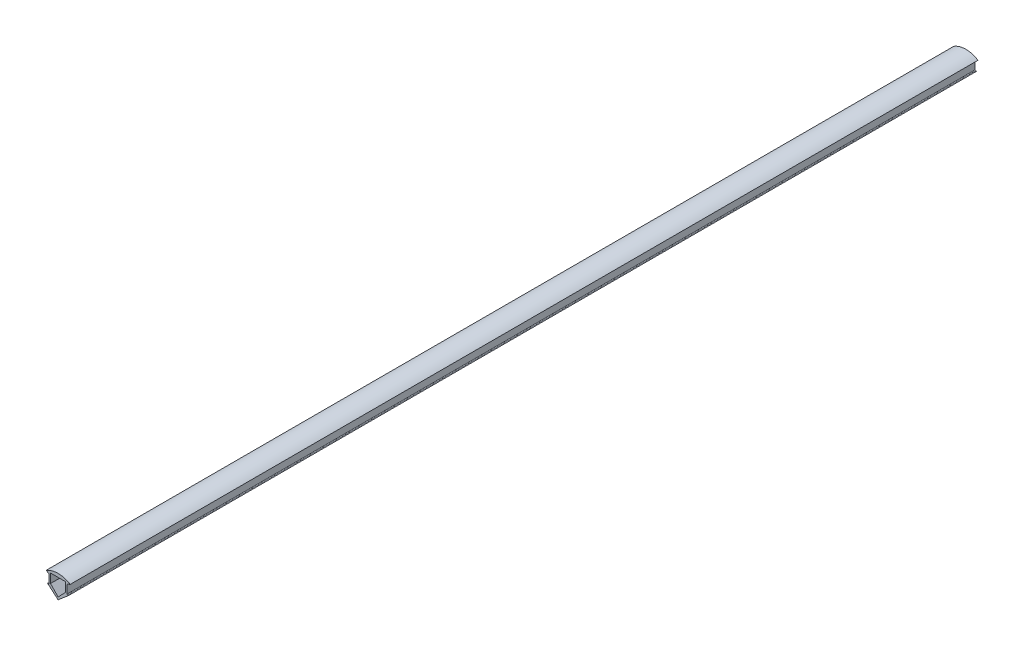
ISO-10303-21;
HEADER;
FILE_DESCRIPTION(('STEP AP214'),'2;1');
FILE_NAME('part.step','',(''),(''),'','','');
FILE_SCHEMA(('AUTOMOTIVE_DESIGN { 1 0 10303 214 1 1 1 1 }'));
ENDSEC;
DATA;
#1=APPLICATION_CONTEXT('core data for automotive mechanical design processes');
#2=APPLICATION_PROTOCOL_DEFINITION('international standard','automotive_design',2000,#1);
#3=PRODUCT_CONTEXT('',#1,'mechanical');
#4=PRODUCT('Part','Part','',(#3));
#5=PRODUCT_RELATED_PRODUCT_CATEGORY('part','',(#4));
#6=PRODUCT_DEFINITION_FORMATION('','',#4);
#7=PRODUCT_DEFINITION_CONTEXT('part definition',#1,'design');
#8=PRODUCT_DEFINITION('design','',#6,#7);
#9=PRODUCT_DEFINITION_SHAPE('','',#8);
#10=(LENGTH_UNIT() NAMED_UNIT(*) SI_UNIT(.MILLI.,.METRE.));
#11=(NAMED_UNIT(*) PLANE_ANGLE_UNIT() SI_UNIT($,.RADIAN.));
#12=(NAMED_UNIT(*) SI_UNIT($,.STERADIAN.) SOLID_ANGLE_UNIT());
#13=UNCERTAINTY_MEASURE_WITH_UNIT(LENGTH_MEASURE(1.E-05),#10,'distance_accuracy_value','');
#14=(GEOMETRIC_REPRESENTATION_CONTEXT(3) GLOBAL_UNCERTAINTY_ASSIGNED_CONTEXT((#13)) GLOBAL_UNIT_ASSIGNED_CONTEXT((#10,
#11,#12)) REPRESENTATION_CONTEXT('',''));
#15=CARTESIAN_POINT('',(0.,0.,0.));
#16=DIRECTION('',(0.,0.,1.));
#17=DIRECTION('',(1.,0.,0.));
#18=AXIS2_PLACEMENT_3D('',#15,#16,#17);
#19=CARTESIAN_POINT('',(-3.2,0.200000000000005,150.));
#20=DIRECTION('',(0.,0.,1.));
#21=DIRECTION('',(1.,0.,0.));
#22=AXIS2_PLACEMENT_3D('',#19,#20,#21);
#23=PLANE('',#22);
#24=CARTESIAN_POINT('',(-3.2,0.200000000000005,150.));
#25=DIRECTION('',(0.,0.,-1.));
#26=DIRECTION('',(1.,0.,0.));
#27=AXIS2_PLACEMENT_3D('',#24,#25,#26);
#28=CIRCLE('',#27,0.2);
#29=CARTESIAN_POINT('',(-3.,0.200000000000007,150.));
#30=VERTEX_POINT('',#29);
#31=CARTESIAN_POINT('',(-3.20000000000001,0.,150.));
#32=VERTEX_POINT('',#31);
#33=EDGE_CURVE('E205',#30,#32,#28,.T.);
#34=ORIENTED_EDGE('',*,*,#33,.T.);
#35=DIRECTION('',(-1.,0.,0.));
#36=VECTOR('',#35,1.);
#37=CARTESIAN_POINT('',(-3.5,0.,150.));
#38=LINE('',#37,#36);
#39=CARTESIAN_POINT('',(-3.5,0.,150.));
#40=VERTEX_POINT('',#39);
#41=EDGE_CURVE('E208',#32,#40,#38,.T.);
#42=ORIENTED_EDGE('',*,*,#41,.T.);
#43=DIRECTION('',(0.759256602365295,-0.65079137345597,0.));
#44=VECTOR('',#43,1.);
#45=CARTESIAN_POINT('',(0.,-3.,150.));
#46=LINE('',#45,#44);
#47=CARTESIAN_POINT('',(0.,-3.,150.));
#48=VERTEX_POINT('',#47);
#49=EDGE_CURVE('E211',#40,#48,#46,.T.);
#50=ORIENTED_EDGE('',*,*,#49,.T.);
#51=DIRECTION('',(0.759256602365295,0.65079137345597,0.));
#52=VECTOR('',#51,1.);
#53=CARTESIAN_POINT('',(0.,-3.,150.));
#54=LINE('',#53,#52);
#55=CARTESIAN_POINT('',(3.5,0.,150.));
#56=VERTEX_POINT('',#55);
#57=EDGE_CURVE('E213',#48,#56,#54,.T.);
#58=ORIENTED_EDGE('',*,*,#57,.T.);
#59=DIRECTION('',(-1.,0.,0.));
#60=VECTOR('',#59,1.);
#61=CARTESIAN_POINT('',(3.5,0.,150.));
#62=LINE('',#61,#60);
#63=CARTESIAN_POINT('',(3.20000000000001,0.,150.));
#64=VERTEX_POINT('',#63);
#65=EDGE_CURVE('E215',#56,#64,#62,.T.);
#66=ORIENTED_EDGE('',*,*,#65,.T.);
#67=CARTESIAN_POINT('',(3.2,0.200000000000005,150.));
#68=DIRECTION('',(0.,0.,-1.));
#69=DIRECTION('',(-1.,0.,0.));
#70=AXIS2_PLACEMENT_3D('',#67,#68,#69);
#71=CIRCLE('',#70,0.2);
#72=CARTESIAN_POINT('',(3.,0.200000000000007,150.));
#73=VERTEX_POINT('',#72);
#74=EDGE_CURVE('E217',#64,#73,#71,.T.);
#75=ORIENTED_EDGE('',*,*,#74,.T.);
#76=DIRECTION('',(0.,1.,0.));
#77=VECTOR('',#76,1.);
#78=CARTESIAN_POINT('',(3.,0.200000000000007,150.));
#79=LINE('',#78,#77);
#80=CARTESIAN_POINT('',(3.,2.867696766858,150.));
#81=VERTEX_POINT('',#80);
#82=EDGE_CURVE('E219',#73,#81,#79,.T.);
#83=ORIENTED_EDGE('',*,*,#82,.T.);
#84=CARTESIAN_POINT('',(3.2,2.867696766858,150.));
#85=DIRECTION('',(0.,0.,-1.));
#86=DIRECTION('',(-1.,0.,0.));
#87=AXIS2_PLACEMENT_3D('',#84,#85,#86);
#88=CIRCLE('',#87,0.2);
#89=CARTESIAN_POINT('',(3.12175919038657,3.05175756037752,150.));
#90=VERTEX_POINT('',#89);
#91=EDGE_CURVE('E221',#81,#90,#88,.T.);
#92=ORIENTED_EDGE('',*,*,#91,.T.);
#93=DIRECTION('',(0.920303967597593,0.391204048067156,0.));
#94=VECTOR('',#93,1.);
#95=CARTESIAN_POINT('',(4.,3.42508134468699,150.));
#96=LINE('',#95,#94);
#97=CARTESIAN_POINT('',(4.,3.42508134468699,150.));
#98=VERTEX_POINT('',#97);
#99=EDGE_CURVE('E223',#90,#98,#96,.T.);
#100=ORIENTED_EDGE('',*,*,#99,.T.);
#101=CARTESIAN_POINT('',(0.,-3.,150.));
#102=DIRECTION('',(0.,0.,1.));
#103=DIRECTION('',(1.,0.,0.));
#104=AXIS2_PLACEMENT_3D('',#101,#102,#103);
#105=CIRCLE('',#104,7.56846551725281);
#106=CARTESIAN_POINT('',(-4.,3.42508134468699,150.));
#107=VERTEX_POINT('',#106);
#108=EDGE_CURVE('E225',#98,#107,#105,.T.);
#109=ORIENTED_EDGE('',*,*,#108,.T.);
#110=DIRECTION('',(0.920303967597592,-0.391204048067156,0.));
#111=VECTOR('',#110,1.);
#112=CARTESIAN_POINT('',(-4.,3.42508134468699,150.));
#113=LINE('',#112,#111);
#114=CARTESIAN_POINT('',(-3.12175919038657,3.05175756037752,150.));
#115=VERTEX_POINT('',#114);
#116=EDGE_CURVE('E227',#107,#115,#113,.T.);
#117=ORIENTED_EDGE('',*,*,#116,.T.);
#118=CARTESIAN_POINT('',(-3.2,2.867696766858,150.));
#119=DIRECTION('',(0.,0.,-1.));
#120=DIRECTION('',(1.,0.,0.));
#121=AXIS2_PLACEMENT_3D('',#118,#119,#120);
#122=CIRCLE('',#121,0.2);
#123=CARTESIAN_POINT('',(-3.,2.867696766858,150.));
#124=VERTEX_POINT('',#123);
#125=EDGE_CURVE('E229',#115,#124,#122,.T.);
#126=ORIENTED_EDGE('',*,*,#125,.T.);
#127=DIRECTION('',(0.,-1.,0.));
#128=VECTOR('',#127,1.);
#129=CARTESIAN_POINT('',(-3.,0.200000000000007,150.));
#130=LINE('',#129,#128);
#131=EDGE_CURVE('E231',#124,#30,#130,.T.);
#132=ORIENTED_EDGE('',*,*,#131,.T.);
#133=EDGE_LOOP('',(#34,#42,#50,#58,#66,#75,#83,#92,#100,#109,#117,#126,#132));
#134=FACE_BOUND('',#133,.T.);
#135=DIRECTION('',(0.,1.,0.));
#136=VECTOR('',#135,1.);
#137=CARTESIAN_POINT('',(2.5,3.42508134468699,150.));
#138=LINE('',#137,#136);
#139=CARTESIAN_POINT('',(2.5,0.425081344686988,150.));
#140=VERTEX_POINT('',#139);
#141=CARTESIAN_POINT('',(2.5,3.42508134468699,150.));
#142=VERTEX_POINT('',#141);
#143=EDGE_CURVE('E169',#140,#142,#138,.T.);
#144=ORIENTED_EDGE('',*,*,#143,.F.);
#145=DIRECTION('',(0.689592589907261,0.724197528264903,0.));
#146=VECTOR('',#145,1.);
#147=CARTESIAN_POINT('',(0.,-2.20037294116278,150.));
#148=LINE('',#147,#146);
#149=CARTESIAN_POINT('',(0.,-2.20037294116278,150.));
#150=VERTEX_POINT('',#149);
#151=EDGE_CURVE('E161',#150,#140,#148,.T.);
#152=ORIENTED_EDGE('',*,*,#151,.F.);
#153=DIRECTION('',(0.689592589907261,-0.724197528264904,0.));
#154=VECTOR('',#153,1.);
#155=CARTESIAN_POINT('',(-2.5,0.425081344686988,150.));
#156=LINE('',#155,#154);
#157=CARTESIAN_POINT('',(-2.5,0.425081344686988,150.));
#158=VERTEX_POINT('',#157);
#159=EDGE_CURVE('E188',#158,#150,#156,.T.);
#160=ORIENTED_EDGE('',*,*,#159,.F.);
#161=DIRECTION('',(0.,-1.,0.));
#162=VECTOR('',#161,1.);
#163=CARTESIAN_POINT('',(-2.5,3.42508134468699,150.));
#164=LINE('',#163,#162);
#165=CARTESIAN_POINT('',(-2.5,3.42508134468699,150.));
#166=VERTEX_POINT('',#165);
#167=EDGE_CURVE('E184',#166,#158,#164,.T.);
#168=ORIENTED_EDGE('',*,*,#167,.F.);
#169=DIRECTION('',(-1.,0.,0.));
#170=VECTOR('',#169,1.);
#171=CARTESIAN_POINT('',(-2.5,3.42508134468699,150.));
#172=LINE('',#171,#170);
#173=EDGE_CURVE('E182',#142,#166,#172,.T.);
#174=ORIENTED_EDGE('',*,*,#173,.F.);
#175=EDGE_LOOP('',(#144,#152,#160,#168,#174));
#176=FACE_BOUND('',#175,.T.);
#177=ADVANCED_FACE('F36',(#134,#176),#23,.T.);
#178=CARTESIAN_POINT('',(-3.2,0.200000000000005,-150.));
#179=DIRECTION('',(0.,0.,1.));
#180=DIRECTION('',(1.,0.,0.));
#181=AXIS2_PLACEMENT_3D('',#178,#179,#180);
#182=PLANE('',#181);
#183=CARTESIAN_POINT('',(-3.2,0.200000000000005,-150.));
#184=DIRECTION('',(0.,0.,-1.));
#185=DIRECTION('',(1.,0.,0.));
#186=AXIS2_PLACEMENT_3D('',#183,#184,#185);
#187=CIRCLE('',#186,0.2);
#188=CARTESIAN_POINT('',(-3.,0.200000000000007,-150.));
#189=VERTEX_POINT('',#188);
#190=CARTESIAN_POINT('',(-3.20000000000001,0.,-150.));
#191=VERTEX_POINT('',#190);
#192=EDGE_CURVE('E177',#189,#191,#187,.T.);
#193=ORIENTED_EDGE('',*,*,#192,.F.);
#194=DIRECTION('',(0.,-1.,0.));
#195=VECTOR('',#194,1.);
#196=CARTESIAN_POINT('',(-3.,0.200000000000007,-150.));
#197=LINE('',#196,#195);
#198=CARTESIAN_POINT('',(-3.,2.867696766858,-150.));
#199=VERTEX_POINT('',#198);
#200=EDGE_CURVE('E209',#199,#189,#197,.T.);
#201=ORIENTED_EDGE('',*,*,#200,.F.);
#202=CARTESIAN_POINT('',(-3.2,2.867696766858,-150.));
#203=DIRECTION('',(0.,0.,-1.));
#204=DIRECTION('',(1.,0.,0.));
#205=AXIS2_PLACEMENT_3D('',#202,#203,#204);
#206=CIRCLE('',#205,0.2);
#207=CARTESIAN_POINT('',(-3.12175919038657,3.05175756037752,-150.));
#208=VERTEX_POINT('',#207);
#209=EDGE_CURVE('E256',#208,#199,#206,.T.);
#210=ORIENTED_EDGE('',*,*,#209,.F.);
#211=DIRECTION('',(0.920303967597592,-0.391204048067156,0.));
#212=VECTOR('',#211,1.);
#213=CARTESIAN_POINT('',(-4.,3.42508134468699,-150.));
#214=LINE('',#213,#212);
#215=CARTESIAN_POINT('',(-4.,3.42508134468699,-150.));
#216=VERTEX_POINT('',#215);
#217=EDGE_CURVE('E254',#216,#208,#214,.T.);
#218=ORIENTED_EDGE('',*,*,#217,.F.);
#219=CARTESIAN_POINT('',(0.,-3.,-150.));
#220=DIRECTION('',(0.,0.,1.));
#221=DIRECTION('',(1.,0.,0.));
#222=AXIS2_PLACEMENT_3D('',#219,#220,#221);
#223=CIRCLE('',#222,7.56846551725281);
#224=CARTESIAN_POINT('',(4.,3.42508134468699,-150.));
#225=VERTEX_POINT('',#224);
#226=EDGE_CURVE('E252',#225,#216,#223,.T.);
#227=ORIENTED_EDGE('',*,*,#226,.F.);
#228=DIRECTION('',(0.920303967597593,0.391204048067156,0.));
#229=VECTOR('',#228,1.);
#230=CARTESIAN_POINT('',(4.,3.42508134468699,-150.));
#231=LINE('',#230,#229);
#232=CARTESIAN_POINT('',(3.12175919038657,3.05175756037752,-150.));
#233=VERTEX_POINT('',#232);
#234=EDGE_CURVE('E250',#233,#225,#231,.T.);
#235=ORIENTED_EDGE('',*,*,#234,.F.);
#236=CARTESIAN_POINT('',(3.2,2.867696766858,-150.));
#237=DIRECTION('',(0.,0.,-1.));
#238=DIRECTION('',(-1.,0.,0.));
#239=AXIS2_PLACEMENT_3D('',#236,#237,#238);
#240=CIRCLE('',#239,0.2);
#241=CARTESIAN_POINT('',(3.,2.867696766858,-150.));
#242=VERTEX_POINT('',#241);
#243=EDGE_CURVE('E248',#242,#233,#240,.T.);
#244=ORIENTED_EDGE('',*,*,#243,.F.);
#245=DIRECTION('',(0.,1.,0.));
#246=VECTOR('',#245,1.);
#247=CARTESIAN_POINT('',(3.,0.200000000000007,-150.));
#248=LINE('',#247,#246);
#249=CARTESIAN_POINT('',(3.,0.200000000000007,-150.));
#250=VERTEX_POINT('',#249);
#251=EDGE_CURVE('E246',#250,#242,#248,.T.);
#252=ORIENTED_EDGE('',*,*,#251,.F.);
#253=CARTESIAN_POINT('',(3.2,0.200000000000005,-150.));
#254=DIRECTION('',(0.,0.,-1.));
#255=DIRECTION('',(-1.,0.,0.));
#256=AXIS2_PLACEMENT_3D('',#253,#254,#255);
#257=CIRCLE('',#256,0.2);
#258=CARTESIAN_POINT('',(3.20000000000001,0.,-150.));
#259=VERTEX_POINT('',#258);
#260=EDGE_CURVE('E244',#259,#250,#257,.T.);
#261=ORIENTED_EDGE('',*,*,#260,.F.);
#262=DIRECTION('',(-1.,0.,0.));
#263=VECTOR('',#262,1.);
#264=CARTESIAN_POINT('',(3.5,0.,-150.));
#265=LINE('',#264,#263);
#266=CARTESIAN_POINT('',(3.5,0.,-150.));
#267=VERTEX_POINT('',#266);
#268=EDGE_CURVE('E242',#267,#259,#265,.T.);
#269=ORIENTED_EDGE('',*,*,#268,.F.);
#270=DIRECTION('',(0.759256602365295,0.65079137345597,0.));
#271=VECTOR('',#270,1.);
#272=CARTESIAN_POINT('',(0.,-3.,-150.));
#273=LINE('',#272,#271);
#274=CARTESIAN_POINT('',(0.,-3.,-150.));
#275=VERTEX_POINT('',#274);
#276=EDGE_CURVE('E240',#275,#267,#273,.T.);
#277=ORIENTED_EDGE('',*,*,#276,.F.);
#278=DIRECTION('',(0.759256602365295,-0.65079137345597,0.));
#279=VECTOR('',#278,1.);
#280=CARTESIAN_POINT('',(0.,-3.,-150.));
#281=LINE('',#280,#279);
#282=CARTESIAN_POINT('',(-3.5,0.,-150.));
#283=VERTEX_POINT('',#282);
#284=EDGE_CURVE('E238',#283,#275,#281,.T.);
#285=ORIENTED_EDGE('',*,*,#284,.F.);
#286=DIRECTION('',(-1.,0.,0.));
#287=VECTOR('',#286,1.);
#288=CARTESIAN_POINT('',(-3.5,0.,-150.));
#289=LINE('',#288,#287);
#290=EDGE_CURVE('E236',#191,#283,#289,.T.);
#291=ORIENTED_EDGE('',*,*,#290,.F.);
#292=EDGE_LOOP('',(#193,#201,#210,#218,#227,#235,#244,#252,#261,#269,#277,#285,#291));
#293=FACE_BOUND('',#292,.T.);
#294=DIRECTION('',(0.689592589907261,0.724197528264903,0.));
#295=VECTOR('',#294,1.);
#296=CARTESIAN_POINT('',(0.,-2.20037294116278,-150.));
#297=LINE('',#296,#295);
#298=CARTESIAN_POINT('',(0.,-2.20037294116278,-150.));
#299=VERTEX_POINT('',#298);
#300=CARTESIAN_POINT('',(2.5,0.425081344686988,-150.));
#301=VERTEX_POINT('',#300);
#302=EDGE_CURVE('E59',#299,#301,#297,.T.);
#303=ORIENTED_EDGE('',*,*,#302,.T.);
#304=DIRECTION('',(0.,1.,0.));
#305=VECTOR('',#304,1.);
#306=CARTESIAN_POINT('',(2.5,3.42508134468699,-150.));
#307=LINE('',#306,#305);
#308=CARTESIAN_POINT('',(2.5,3.42508134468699,-150.));
#309=VERTEX_POINT('',#308);
#310=EDGE_CURVE('E176',#301,#309,#307,.T.);
#311=ORIENTED_EDGE('',*,*,#310,.T.);
#312=DIRECTION('',(-1.,0.,0.));
#313=VECTOR('',#312,1.);
#314=CARTESIAN_POINT('',(-2.5,3.42508134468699,-150.));
#315=LINE('',#314,#313);
#316=CARTESIAN_POINT('',(-2.5,3.42508134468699,-150.));
#317=VERTEX_POINT('',#316);
#318=EDGE_CURVE('E192',#309,#317,#315,.T.);
#319=ORIENTED_EDGE('',*,*,#318,.T.);
#320=DIRECTION('',(0.,-1.,0.));
#321=VECTOR('',#320,1.);
#322=CARTESIAN_POINT('',(-2.5,3.42508134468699,-150.));
#323=LINE('',#322,#321);
#324=CARTESIAN_POINT('',(-2.5,0.425081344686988,-150.));
#325=VERTEX_POINT('',#324);
#326=EDGE_CURVE('E195',#317,#325,#323,.T.);
#327=ORIENTED_EDGE('',*,*,#326,.T.);
#328=DIRECTION('',(0.689592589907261,-0.724197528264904,0.));
#329=VECTOR('',#328,1.);
#330=CARTESIAN_POINT('',(-2.5,0.425081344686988,-150.));
#331=LINE('',#330,#329);
#332=EDGE_CURVE('E170',#325,#299,#331,.T.);
#333=ORIENTED_EDGE('',*,*,#332,.T.);
#334=EDGE_LOOP('',(#303,#311,#319,#327,#333));
#335=FACE_BOUND('',#334,.T.);
#336=ADVANCED_FACE('F301',(#293,#335),#182,.F.);
#337=CARTESIAN_POINT('',(-3.2,0.200000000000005,150.));
#338=DIRECTION('',(0.,0.,-1.));
#339=DIRECTION('',(-1.,0.,0.));
#340=AXIS2_PLACEMENT_3D('',#337,#338,#339);
#341=CYLINDRICAL_SURFACE('',#340,0.2);
#342=ORIENTED_EDGE('',*,*,#192,.T.);
#343=DIRECTION('',(0.,0.,-1.));
#344=VECTOR('',#343,1.);
#345=CARTESIAN_POINT('',(-3.20000000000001,0.,150.));
#346=LINE('',#345,#344);
#347=EDGE_CURVE('E11',#32,#191,#346,.T.);
#348=ORIENTED_EDGE('',*,*,#347,.F.);
#349=ORIENTED_EDGE('',*,*,#33,.F.);
#350=DIRECTION('',(0.,0.,-1.));
#351=VECTOR('',#350,1.);
#352=CARTESIAN_POINT('',(-3.,0.200000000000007,150.));
#353=LINE('',#352,#351);
#354=EDGE_CURVE('E233',#30,#189,#353,.T.);
#355=ORIENTED_EDGE('',*,*,#354,.T.);
#356=EDGE_LOOP('',(#342,#348,#349,#355));
#357=FACE_BOUND('',#356,.T.);
#358=ADVANCED_FACE('F38',(#357),#341,.F.);
#359=CARTESIAN_POINT('',(-3.5,0.,150.));
#360=DIRECTION('',(0.,-1.,0.));
#361=DIRECTION('',(1.,0.,0.));
#362=AXIS2_PLACEMENT_3D('',#359,#360,#361);
#363=PLANE('',#362);
#364=ORIENTED_EDGE('',*,*,#290,.T.);
#365=DIRECTION('',(0.,0.,-1.));
#366=VECTOR('',#365,1.);
#367=CARTESIAN_POINT('',(-3.5,0.,150.));
#368=LINE('',#367,#366);
#369=EDGE_CURVE('E44',#40,#283,#368,.T.);
#370=ORIENTED_EDGE('',*,*,#369,.F.);
#371=ORIENTED_EDGE('',*,*,#41,.F.);
#372=ORIENTED_EDGE('',*,*,#347,.T.);
#373=EDGE_LOOP('',(#364,#370,#371,#372));
#374=FACE_BOUND('',#373,.T.);
#375=ADVANCED_FACE('F318',(#374),#363,.F.);
#376=CARTESIAN_POINT('',(0.,-3.,150.));
#377=DIRECTION('',(0.65079137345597,0.759256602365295,0.));
#378=DIRECTION('',(-0.759256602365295,0.65079137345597,0.));
#379=AXIS2_PLACEMENT_3D('',#376,#377,#378);
#380=PLANE('',#379);
#381=ORIENTED_EDGE('',*,*,#284,.T.);
#382=DIRECTION('',(0.,0.,-1.));
#383=VECTOR('',#382,1.);
#384=CARTESIAN_POINT('',(0.,-3.,150.));
#385=LINE('',#384,#383);
#386=EDGE_CURVE('E288',#48,#275,#385,.T.);
#387=ORIENTED_EDGE('',*,*,#386,.F.);
#388=ORIENTED_EDGE('',*,*,#49,.F.);
#389=ORIENTED_EDGE('',*,*,#369,.T.);
#390=EDGE_LOOP('',(#381,#387,#388,#389));
#391=FACE_BOUND('',#390,.T.);
#392=ADVANCED_FACE('F295',(#391),#380,.F.);
#393=CARTESIAN_POINT('',(0.,-3.,150.));
#394=DIRECTION('',(-0.65079137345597,0.759256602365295,0.));
#395=DIRECTION('',(-0.759256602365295,-0.65079137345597,0.));
#396=AXIS2_PLACEMENT_3D('',#393,#394,#395);
#397=PLANE('',#396);
#398=ORIENTED_EDGE('',*,*,#276,.T.);
#399=DIRECTION('',(0.,0.,-1.));
#400=VECTOR('',#399,1.);
#401=CARTESIAN_POINT('',(3.5,0.,150.));
#402=LINE('',#401,#400);
#403=EDGE_CURVE('E285',#56,#267,#402,.T.);
#404=ORIENTED_EDGE('',*,*,#403,.F.);
#405=ORIENTED_EDGE('',*,*,#57,.F.);
#406=ORIENTED_EDGE('',*,*,#386,.T.);
#407=EDGE_LOOP('',(#398,#404,#405,#406));
#408=FACE_BOUND('',#407,.T.);
#409=ADVANCED_FACE('F307',(#408),#397,.F.);
#410=CARTESIAN_POINT('',(3.5,0.,150.));
#411=DIRECTION('',(0.,-1.,0.));
#412=DIRECTION('',(1.,0.,0.));
#413=AXIS2_PLACEMENT_3D('',#410,#411,#412);
#414=PLANE('',#413);
#415=ORIENTED_EDGE('',*,*,#268,.T.);
#416=DIRECTION('',(0.,0.,-1.));
#417=VECTOR('',#416,1.);
#418=CARTESIAN_POINT('',(3.20000000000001,0.,150.));
#419=LINE('',#418,#417);
#420=EDGE_CURVE('E282',#64,#259,#419,.T.);
#421=ORIENTED_EDGE('',*,*,#420,.F.);
#422=ORIENTED_EDGE('',*,*,#65,.F.);
#423=ORIENTED_EDGE('',*,*,#403,.T.);
#424=EDGE_LOOP('',(#415,#421,#422,#423));
#425=FACE_BOUND('',#424,.T.);
#426=ADVANCED_FACE('F311',(#425),#414,.F.);
#427=CARTESIAN_POINT('',(3.2,0.200000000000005,150.));
#428=DIRECTION('',(0.,0.,-1.));
#429=DIRECTION('',(-1.,0.,0.));
#430=AXIS2_PLACEMENT_3D('',#427,#428,#429);
#431=CYLINDRICAL_SURFACE('',#430,0.2);
#432=ORIENTED_EDGE('',*,*,#260,.T.);
#433=DIRECTION('',(0.,0.,-1.));
#434=VECTOR('',#433,1.);
#435=CARTESIAN_POINT('',(3.,0.200000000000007,150.));
#436=LINE('',#435,#434);
#437=EDGE_CURVE('E279',#73,#250,#436,.T.);
#438=ORIENTED_EDGE('',*,*,#437,.F.);
#439=ORIENTED_EDGE('',*,*,#74,.F.);
#440=ORIENTED_EDGE('',*,*,#420,.T.);
#441=EDGE_LOOP('',(#432,#438,#439,#440));
#442=FACE_BOUND('',#441,.T.);
#443=ADVANCED_FACE('F356',(#442),#431,.F.);
#444=CARTESIAN_POINT('',(3.,0.200000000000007,150.));
#445=DIRECTION('',(-1.,0.,0.));
#446=DIRECTION('',(0.,0.,1.));
#447=AXIS2_PLACEMENT_3D('',#444,#445,#446);
#448=PLANE('',#447);
#449=ORIENTED_EDGE('',*,*,#251,.T.);
#450=DIRECTION('',(0.,0.,-1.));
#451=VECTOR('',#450,1.);
#452=CARTESIAN_POINT('',(3.,2.867696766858,150.));
#453=LINE('',#452,#451);
#454=EDGE_CURVE('E276',#81,#242,#453,.T.);
#455=ORIENTED_EDGE('',*,*,#454,.F.);
#456=ORIENTED_EDGE('',*,*,#82,.F.);
#457=ORIENTED_EDGE('',*,*,#437,.T.);
#458=EDGE_LOOP('',(#449,#455,#456,#457));
#459=FACE_BOUND('',#458,.T.);
#460=ADVANCED_FACE('F353',(#459),#448,.F.);
#461=CARTESIAN_POINT('',(3.2,2.867696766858,150.));
#462=DIRECTION('',(0.,0.,-1.));
#463=DIRECTION('',(-1.,0.,0.));
#464=AXIS2_PLACEMENT_3D('',#461,#462,#463);
#465=CYLINDRICAL_SURFACE('',#464,0.2);
#466=ORIENTED_EDGE('',*,*,#243,.T.);
#467=DIRECTION('',(0.,0.,-1.));
#468=VECTOR('',#467,1.);
#469=CARTESIAN_POINT('',(3.12175919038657,3.05175756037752,150.));
#470=LINE('',#469,#468);
#471=EDGE_CURVE('E273',#90,#233,#470,.T.);
#472=ORIENTED_EDGE('',*,*,#471,.F.);
#473=ORIENTED_EDGE('',*,*,#91,.F.);
#474=ORIENTED_EDGE('',*,*,#454,.T.);
#475=EDGE_LOOP('',(#466,#472,#473,#474));
#476=FACE_BOUND('',#475,.T.);
#477=ADVANCED_FACE('F349',(#476),#465,.F.);
#478=CARTESIAN_POINT('',(4.,3.42508134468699,150.));
#479=DIRECTION('',(-0.391204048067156,0.920303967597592,0.));
#480=DIRECTION('',(-0.920303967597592,-0.391204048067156,0.));
#481=AXIS2_PLACEMENT_3D('',#478,#479,#480);
#482=PLANE('',#481);
#483=ORIENTED_EDGE('',*,*,#234,.T.);
#484=DIRECTION('',(0.,0.,-1.));
#485=VECTOR('',#484,1.);
#486=CARTESIAN_POINT('',(4.,3.42508134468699,150.));
#487=LINE('',#486,#485);
#488=EDGE_CURVE('E270',#98,#225,#487,.T.);
#489=ORIENTED_EDGE('',*,*,#488,.F.);
#490=ORIENTED_EDGE('',*,*,#99,.F.);
#491=ORIENTED_EDGE('',*,*,#471,.T.);
#492=EDGE_LOOP('',(#483,#489,#490,#491));
#493=FACE_BOUND('',#492,.T.);
#494=ADVANCED_FACE('F345',(#493),#482,.F.);
#495=CARTESIAN_POINT('',(0.,-3.,150.));
#496=DIRECTION('',(0.,0.,-1.));
#497=DIRECTION('',(-1.,0.,0.));
#498=AXIS2_PLACEMENT_3D('',#495,#496,#497);
#499=CYLINDRICAL_SURFACE('',#498,7.56846551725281);
#500=ORIENTED_EDGE('',*,*,#226,.T.);
#501=DIRECTION('',(0.,0.,-1.));
#502=VECTOR('',#501,1.);
#503=CARTESIAN_POINT('',(-4.,3.42508134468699,150.));
#504=LINE('',#503,#502);
#505=EDGE_CURVE('E267',#107,#216,#504,.T.);
#506=ORIENTED_EDGE('',*,*,#505,.F.);
#507=ORIENTED_EDGE('',*,*,#108,.F.);
#508=ORIENTED_EDGE('',*,*,#488,.T.);
#509=EDGE_LOOP('',(#500,#506,#507,#508));
#510=FACE_BOUND('',#509,.T.);
#511=ADVANCED_FACE('F340',(#510),#499,.T.);
#512=CARTESIAN_POINT('',(-4.,3.42508134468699,150.));
#513=DIRECTION('',(0.391204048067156,0.920303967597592,0.));
#514=DIRECTION('',(-0.920303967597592,0.391204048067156,0.));
#515=AXIS2_PLACEMENT_3D('',#512,#513,#514);
#516=PLANE('',#515);
#517=ORIENTED_EDGE('',*,*,#217,.T.);
#518=DIRECTION('',(0.,0.,-1.));
#519=VECTOR('',#518,1.);
#520=CARTESIAN_POINT('',(-3.12175919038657,3.05175756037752,150.));
#521=LINE('',#520,#519);
#522=EDGE_CURVE('E264',#115,#208,#521,.T.);
#523=ORIENTED_EDGE('',*,*,#522,.F.);
#524=ORIENTED_EDGE('',*,*,#116,.F.);
#525=ORIENTED_EDGE('',*,*,#505,.T.);
#526=EDGE_LOOP('',(#517,#523,#524,#525));
#527=FACE_BOUND('',#526,.T.);
#528=ADVANCED_FACE('F334',(#527),#516,.F.);
#529=CARTESIAN_POINT('',(-3.2,2.867696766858,150.));
#530=DIRECTION('',(0.,0.,-1.));
#531=DIRECTION('',(-1.,0.,0.));
#532=AXIS2_PLACEMENT_3D('',#529,#530,#531);
#533=CYLINDRICAL_SURFACE('',#532,0.2);
#534=ORIENTED_EDGE('',*,*,#209,.T.);
#535=DIRECTION('',(0.,0.,-1.));
#536=VECTOR('',#535,1.);
#537=CARTESIAN_POINT('',(-3.,2.867696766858,150.));
#538=LINE('',#537,#536);
#539=EDGE_CURVE('E261',#124,#199,#538,.T.);
#540=ORIENTED_EDGE('',*,*,#539,.F.);
#541=ORIENTED_EDGE('',*,*,#125,.F.);
#542=ORIENTED_EDGE('',*,*,#522,.T.);
#543=EDGE_LOOP('',(#534,#540,#541,#542));
#544=FACE_BOUND('',#543,.T.);
#545=ADVANCED_FACE('F330',(#544),#533,.F.);
#546=CARTESIAN_POINT('',(-3.,0.200000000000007,150.));
#547=DIRECTION('',(1.,0.,0.));
#548=DIRECTION('',(0.,0.,-1.));
#549=AXIS2_PLACEMENT_3D('',#546,#547,#548);
#550=PLANE('',#549);
#551=ORIENTED_EDGE('',*,*,#200,.T.);
#552=ORIENTED_EDGE('',*,*,#354,.F.);
#553=ORIENTED_EDGE('',*,*,#131,.F.);
#554=ORIENTED_EDGE('',*,*,#539,.T.);
#555=EDGE_LOOP('',(#551,#552,#553,#554));
#556=FACE_BOUND('',#555,.T.);
#557=ADVANCED_FACE('F325',(#556),#550,.F.);
#558=CARTESIAN_POINT('',(0.,-2.20037294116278,150.));
#559=DIRECTION('',(-0.724197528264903,0.689592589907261,0.));
#560=DIRECTION('',(-0.689592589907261,-0.724197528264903,0.));
#561=AXIS2_PLACEMENT_3D('',#558,#559,#560);
#562=PLANE('',#561);
#563=ORIENTED_EDGE('',*,*,#302,.F.);
#564=DIRECTION('',(0.,0.,-1.));
#565=VECTOR('',#564,1.);
#566=CARTESIAN_POINT('',(0.,-2.20037294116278,150.));
#567=LINE('',#566,#565);
#568=EDGE_CURVE('E165',#150,#299,#567,.T.);
#569=ORIENTED_EDGE('',*,*,#568,.F.);
#570=ORIENTED_EDGE('',*,*,#151,.T.);
#571=DIRECTION('',(0.,0.,-1.));
#572=VECTOR('',#571,1.);
#573=CARTESIAN_POINT('',(2.5,0.425081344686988,150.));
#574=LINE('',#573,#572);
#575=EDGE_CURVE('E164',#140,#301,#574,.T.);
#576=ORIENTED_EDGE('',*,*,#575,.T.);
#577=EDGE_LOOP('',(#563,#569,#570,#576));
#578=FACE_BOUND('',#577,.T.);
#579=ADVANCED_FACE('F163',(#578),#562,.T.);
#580=CARTESIAN_POINT('',(2.5,3.42508134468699,150.));
#581=DIRECTION('',(-1.,0.,0.));
#582=DIRECTION('',(0.,-1.,0.));
#583=AXIS2_PLACEMENT_3D('',#580,#581,#582);
#584=PLANE('',#583);
#585=ORIENTED_EDGE('',*,*,#310,.F.);
#586=ORIENTED_EDGE('',*,*,#575,.F.);
#587=ORIENTED_EDGE('',*,*,#143,.T.);
#588=DIRECTION('',(0.,0.,-1.));
#589=VECTOR('',#588,1.);
#590=CARTESIAN_POINT('',(2.5,3.42508134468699,150.));
#591=LINE('',#590,#589);
#592=EDGE_CURVE('E178',#142,#309,#591,.T.);
#593=ORIENTED_EDGE('',*,*,#592,.T.);
#594=EDGE_LOOP('',(#585,#586,#587,#593));
#595=FACE_BOUND('',#594,.T.);
#596=ADVANCED_FACE('F173',(#595),#584,.T.);
#597=CARTESIAN_POINT('',(-2.5,3.42508134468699,150.));
#598=DIRECTION('',(0.,-1.,0.));
#599=DIRECTION('',(0.,0.,-1.));
#600=AXIS2_PLACEMENT_3D('',#597,#598,#599);
#601=PLANE('',#600);
#602=ORIENTED_EDGE('',*,*,#318,.F.);
#603=ORIENTED_EDGE('',*,*,#592,.F.);
#604=ORIENTED_EDGE('',*,*,#173,.T.);
#605=DIRECTION('',(0.,0.,-1.));
#606=VECTOR('',#605,1.);
#607=CARTESIAN_POINT('',(-2.5,3.42508134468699,150.));
#608=LINE('',#607,#606);
#609=EDGE_CURVE('E202',#166,#317,#608,.T.);
#610=ORIENTED_EDGE('',*,*,#609,.T.);
#611=EDGE_LOOP('',(#602,#603,#604,#610));
#612=FACE_BOUND('',#611,.T.);
#613=ADVANCED_FACE('F420',(#612),#601,.T.);
#614=CARTESIAN_POINT('',(-2.5,3.42508134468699,150.));
#615=DIRECTION('',(1.,0.,0.));
#616=DIRECTION('',(0.,1.,0.));
#617=AXIS2_PLACEMENT_3D('',#614,#615,#616);
#618=PLANE('',#617);
#619=ORIENTED_EDGE('',*,*,#326,.F.);
#620=ORIENTED_EDGE('',*,*,#609,.F.);
#621=ORIENTED_EDGE('',*,*,#167,.T.);
#622=DIRECTION('',(0.,0.,-1.));
#623=VECTOR('',#622,1.);
#624=CARTESIAN_POINT('',(-2.5,0.425081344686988,150.));
#625=LINE('',#624,#623);
#626=EDGE_CURVE('E51',#158,#325,#625,.T.);
#627=ORIENTED_EDGE('',*,*,#626,.T.);
#628=EDGE_LOOP('',(#619,#620,#621,#627));
#629=FACE_BOUND('',#628,.T.);
#630=ADVANCED_FACE('F426',(#629),#618,.T.);
#631=CARTESIAN_POINT('',(-2.5,0.425081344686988,150.));
#632=DIRECTION('',(0.724197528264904,0.689592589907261,0.));
#633=DIRECTION('',(-0.689592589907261,0.724197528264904,0.));
#634=AXIS2_PLACEMENT_3D('',#631,#632,#633);
#635=PLANE('',#634);
#636=ORIENTED_EDGE('',*,*,#332,.F.);
#637=ORIENTED_EDGE('',*,*,#626,.F.);
#638=ORIENTED_EDGE('',*,*,#159,.T.);
#639=ORIENTED_EDGE('',*,*,#568,.T.);
#640=EDGE_LOOP('',(#636,#637,#638,#639));
#641=FACE_BOUND('',#640,.T.);
#642=ADVANCED_FACE('F434',(#641),#635,.T.);
#643=CLOSED_SHELL('',(#177,#336,#358,#375,#392,#409,#426,#443,#460,#477,#494,#511,#528,#545,
#557,#579,#596,#613,#630,#642));
#644=MANIFOLD_SOLID_BREP('B2',#643);
#645=ADVANCED_BREP_SHAPE_REPRESENTATION('',(#18,#644),#14);
#646=SHAPE_DEFINITION_REPRESENTATION(#9,#645);
ENDSEC;
END-ISO-10303-21;
